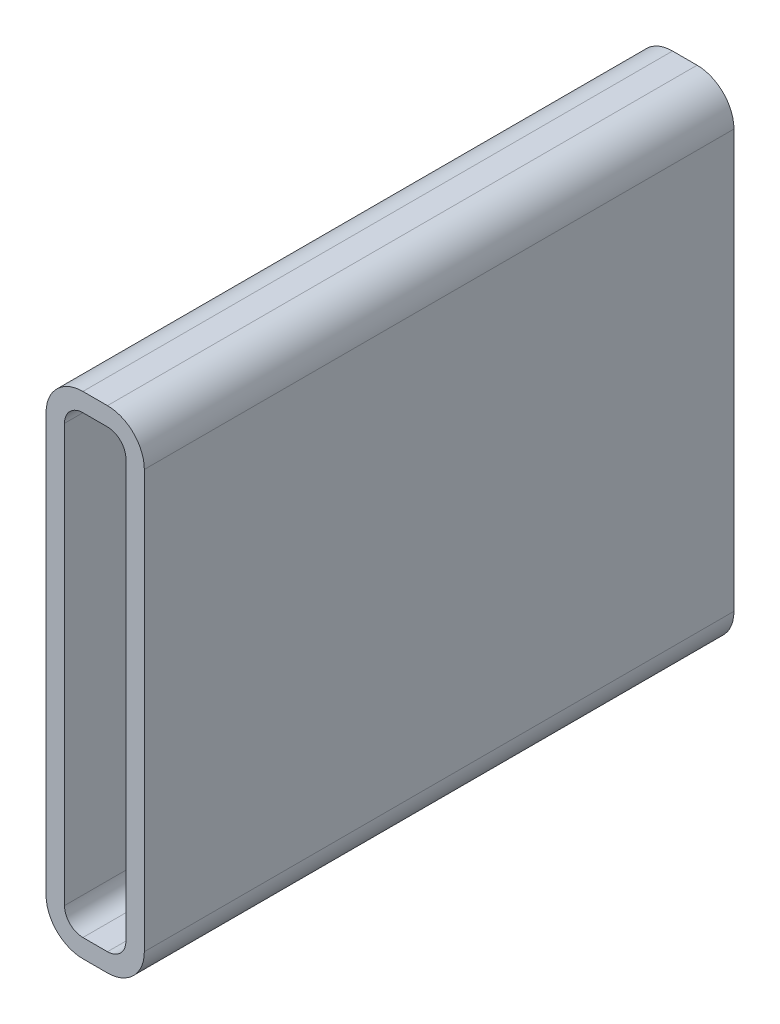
from build123d import *

# Parameters (mm, degrees)
BOSS_EXTRUDE1_DEPTH = 304.8


with BuildPart() as part:
    # Sketch1 → Boss-Extrude1 (new body)
    with BuildSketch(Plane.XY):
        with BuildLine():
            Line((19.05, 254), (31.75, 254))
            ThreePointArc((31.75, 254), (45.220384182, 248.420384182), (50.8, 234.95))
            Line((50.8, 234.95), (50.8, 19.05))
            ThreePointArc((50.8, 19.05), (45.220384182, 5.579615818), (31.75, 0))
            Line((31.75, 0), (19.05, 0))
            ThreePointArc((19.05, 0), (5.579615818, 5.579615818), (0, 19.05))
            Line((0, 19.05), (0, 234.95))
            ThreePointArc((0, 234.95), (5.579615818, 248.420384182), (19.05, 254))
        make_face()
        with BuildLine():
            Line((19.05, 244.475), (31.75, 244.475))
            ThreePointArc((31.75, 244.475), (38.485192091, 241.685192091), (41.275, 234.95))
            Line((41.275, 234.95), (41.275, 19.05))
            ThreePointArc((41.275, 19.05), (38.485192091, 12.314807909), (31.75, 9.525))
            Line((31.75, 9.525), (19.05, 9.525))
            ThreePointArc((19.05, 9.525), (12.314807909, 12.314807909), (9.525, 19.05))
            Line((9.525, 19.05), (9.525, 234.95))
            ThreePointArc((9.525, 234.95), (12.314807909, 241.685192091), (19.05, 244.475))
        make_face(mode=Mode.SUBTRACT)
    extrude(amount=BOSS_EXTRUDE1_DEPTH)


solid = part.part
